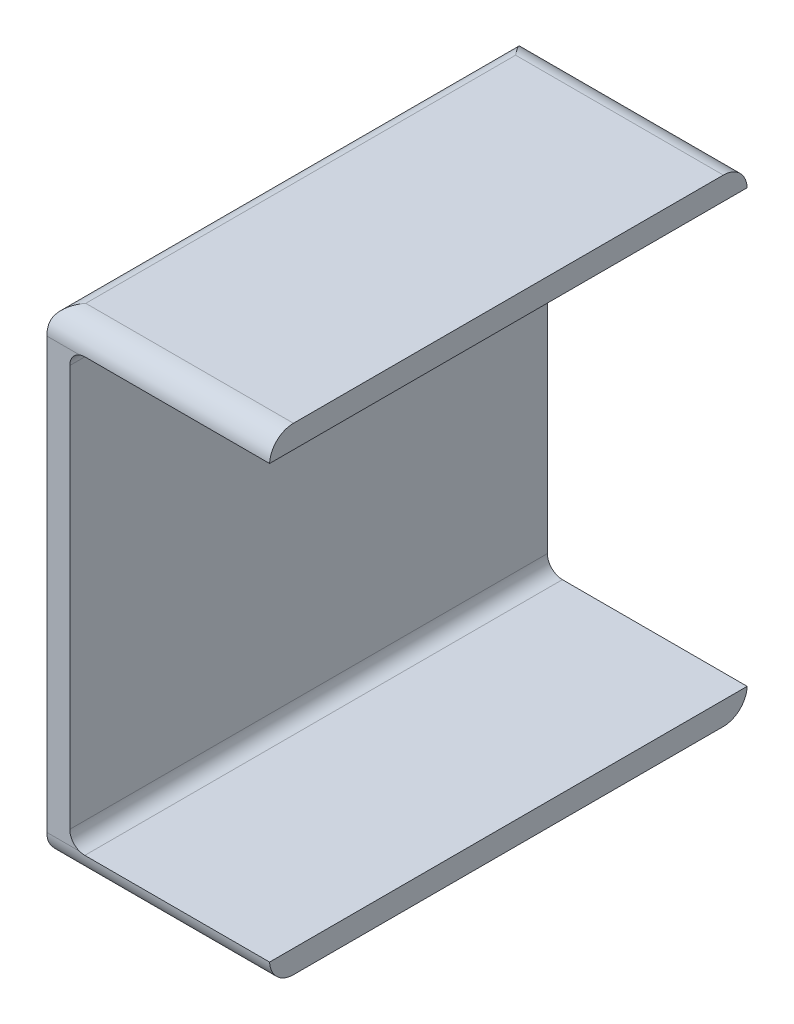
from build123d import *

# Parameters (mm, degrees)
BOSS_EXTRUDE1_DEPTH     = 63.5
CUT_EXTRUDE1_DEPTH      = 95.558977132
CUT_EXTRUDE1_DEPTH_BACK = 95.558977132


with BuildPart() as part:
    # Sketch1 → Boss-Extrude1 (new body)
    with BuildSketch(Plane.XY):
        with BuildLine():
            Line((0, 60.452), (0, 63.5))
            Line((0, 63.5), (-27.6125, 63.5))
            ThreePointArc((-27.6125, 63.5), (-29.026713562, 62.914213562), (-29.6125, 61.5))
            Line((-29.6125, 61.5), (-29.6125, 2))
            ThreePointArc((-29.6125, 2), (-29.026713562, 0.585786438), (-27.6125, 0))
            Line((-27.6125, 0), (0, 0))
            Line((0, 0), (0, 3.048))
            Line((0, 3.048), (-24.5645, 3.048))
            ThreePointArc((-24.5645, 3.048), (-25.978713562, 3.633786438), (-26.5645, 5.048))
            Line((-26.5645, 5.048), (-26.5645, 58.452))
            ThreePointArc((-26.5645, 58.452), (-25.978713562, 59.866213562), (-24.5645, 60.452))
            Line((-24.5645, 60.452), (0, 60.452))
        make_face()
    extrude(amount=BOSS_EXTRUDE1_DEPTH)

    # Sketch2 → Cut-Extrude1 (cut, two sides: drawn at the far end of the back side and taken through both)
    with BuildSketch(Plane(origin=(0, 0, 0), x_dir=(0, 0, -1), z_dir=(1, 0, 0)).offset(-CUT_EXTRUDE1_DEPTH_BACK)):
        with BuildLine():
            Line((-3.175, 63.5), (0, 63.5))
            Line((0, 63.5), (0, 60.325))
            ThreePointArc((0, 60.325), (-0.92993597, 62.57006403), (-3.175, 63.5))
        make_face()
        with BuildLine():
            Line((-3.175, 0), (0, 0))
            Line((0, 0), (0, 3.175))
            ThreePointArc((0, 3.175), (-0.92993597, 0.92993597), (-3.175, 0))
        make_face()
        with BuildLine():
            Line((-60.325, 0), (-63.5, 0))
            Line((-63.5, 0), (-63.5, 3.175))
            ThreePointArc((-63.5, 3.175), (-62.57006403, 0.92993597), (-60.325, 0))
        make_face()
        with BuildLine():
            Line((-63.5, 60.325), (-63.5, 63.5))
            Line((-63.5, 63.5), (-60.325, 63.5))
            ThreePointArc((-60.325, 63.5), (-62.57006403, 62.57006403), (-63.5, 60.325))
        make_face()
    extrude(amount=CUT_EXTRUDE1_DEPTH + CUT_EXTRUDE1_DEPTH_BACK, mode=Mode.SUBTRACT)


solid = part.part
